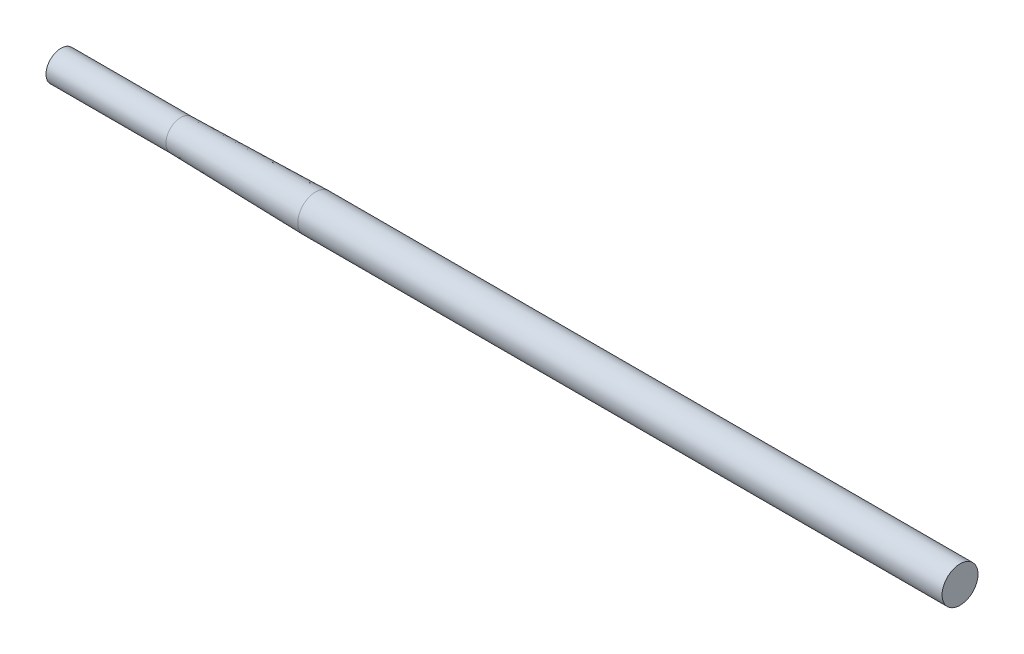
ISO-10303-21;
HEADER;
FILE_DESCRIPTION(('STEP AP214'),'2;1');
FILE_NAME('part.step','',(''),(''),'','','');
FILE_SCHEMA(('AUTOMOTIVE_DESIGN { 1 0 10303 214 1 1 1 1 }'));
ENDSEC;
DATA;
#1=APPLICATION_CONTEXT('core data for automotive mechanical design processes');
#2=APPLICATION_PROTOCOL_DEFINITION('international standard','automotive_design',2000,#1);
#3=PRODUCT_CONTEXT('',#1,'mechanical');
#4=PRODUCT('Part','Part','',(#3));
#5=PRODUCT_RELATED_PRODUCT_CATEGORY('part','',(#4));
#6=PRODUCT_DEFINITION_FORMATION('','',#4);
#7=PRODUCT_DEFINITION_CONTEXT('part definition',#1,'design');
#8=PRODUCT_DEFINITION('design','',#6,#7);
#9=PRODUCT_DEFINITION_SHAPE('','',#8);
#10=(LENGTH_UNIT() NAMED_UNIT(*) SI_UNIT(.MILLI.,.METRE.));
#11=(NAMED_UNIT(*) PLANE_ANGLE_UNIT() SI_UNIT($,.RADIAN.));
#12=(NAMED_UNIT(*) SI_UNIT($,.STERADIAN.) SOLID_ANGLE_UNIT());
#13=UNCERTAINTY_MEASURE_WITH_UNIT(LENGTH_MEASURE(1.E-05),#10,'distance_accuracy_value','');
#14=(GEOMETRIC_REPRESENTATION_CONTEXT(3) GLOBAL_UNCERTAINTY_ASSIGNED_CONTEXT((#13)) GLOBAL_UNIT_ASSIGNED_CONTEXT((#10,
#11,#12)) REPRESENTATION_CONTEXT('',''));
#15=CARTESIAN_POINT('',(0.,0.,0.));
#16=DIRECTION('',(0.,0.,1.));
#17=DIRECTION('',(1.,0.,0.));
#18=AXIS2_PLACEMENT_3D('',#15,#16,#17);
#19=CARTESIAN_POINT('',(300.,0.,0.));
#20=DIRECTION('',(-1.,0.,0.));
#21=DIRECTION('',(0.,0.,1.));
#22=AXIS2_PLACEMENT_3D('',#19,#20,#21);
#23=PLANE('',#22);
#24=CARTESIAN_POINT('',(300.,0.,0.));
#25=DIRECTION('',(-1.,0.,0.));
#26=DIRECTION('',(0.,0.,1.));
#27=AXIS2_PLACEMENT_3D('',#24,#25,#26);
#28=CIRCLE('',#27,6.);
#29=CARTESIAN_POINT('',(300.,0.,6.));
#30=VERTEX_POINT('',#29);
#31=EDGE_CURVE('E10',#30,#30,#28,.T.);
#32=ORIENTED_EDGE('',*,*,#31,.F.);
#33=EDGE_LOOP('',(#32));
#34=FACE_BOUND('',#33,.T.);
#35=ADVANCED_FACE('F31',(#34),#23,.F.);
#36=CARTESIAN_POINT('',(0.,0.,0.));
#37=DIRECTION('',(-1.,0.,0.));
#38=DIRECTION('',(0.,0.,1.));
#39=AXIS2_PLACEMENT_3D('',#36,#37,#38);
#40=CYLINDRICAL_SURFACE('',#39,5.99999999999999);
#41=CARTESIAN_POINT('',(85.,0.,0.));
#42=DIRECTION('',(-1.,0.,0.));
#43=DIRECTION('',(0.,0.,1.));
#44=AXIS2_PLACEMENT_3D('',#41,#42,#43);
#45=CIRCLE('',#44,5.99999999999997);
#46=CARTESIAN_POINT('',(85.,0.,5.99999999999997));
#47=VERTEX_POINT('',#46);
#48=EDGE_CURVE('E37',#47,#47,#45,.T.);
#49=ORIENTED_EDGE('',*,*,#48,.F.);
#50=EDGE_LOOP('',(#49));
#51=FACE_BOUND('',#50,.T.);
#52=ORIENTED_EDGE('',*,*,#31,.T.);
#53=EDGE_LOOP('',(#52));
#54=FACE_BOUND('',#53,.T.);
#55=ADVANCED_FACE('F61',(#51,#54),#40,.T.);
#56=CARTESIAN_POINT('',(85.,0.,0.));
#57=DIRECTION('',(1.,0.,0.));
#58=DIRECTION('',(0.,0.,-1.));
#59=AXIS2_PLACEMENT_3D('',#56,#57,#58);
#60=CONICAL_SURFACE('',#59,5.99999999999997,0.0222185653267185);
#61=CARTESIAN_POINT('',(40.,0.,0.));
#62=DIRECTION('',(-1.,0.,0.));
#63=DIRECTION('',(0.,0.,1.));
#64=AXIS2_PLACEMENT_3D('',#61,#62,#63);
#65=CIRCLE('',#64,5.);
#66=CARTESIAN_POINT('',(40.,0.,5.));
#67=VERTEX_POINT('',#66);
#68=EDGE_CURVE('E41',#67,#67,#65,.T.);
#69=ORIENTED_EDGE('',*,*,#68,.F.);
#70=EDGE_LOOP('',(#69));
#71=FACE_BOUND('',#70,.T.);
#72=ORIENTED_EDGE('',*,*,#48,.T.);
#73=EDGE_LOOP('',(#72));
#74=FACE_BOUND('',#73,.T.);
#75=ADVANCED_FACE('F56',(#71,#74),#60,.T.);
#76=CARTESIAN_POINT('',(0.,0.,0.));
#77=DIRECTION('',(-1.,0.,0.));
#78=DIRECTION('',(0.,0.,1.));
#79=AXIS2_PLACEMENT_3D('',#76,#77,#78);
#80=CYLINDRICAL_SURFACE('',#79,5.);
#81=CARTESIAN_POINT('',(0.,0.,0.));
#82=DIRECTION('',(-1.,0.,0.));
#83=DIRECTION('',(0.,0.,1.));
#84=AXIS2_PLACEMENT_3D('',#81,#82,#83);
#85=CIRCLE('',#84,5.);
#86=CARTESIAN_POINT('',(0.,0.,5.));
#87=VERTEX_POINT('',#86);
#88=EDGE_CURVE('E45',#87,#87,#85,.T.);
#89=ORIENTED_EDGE('',*,*,#88,.F.);
#90=EDGE_LOOP('',(#89));
#91=FACE_BOUND('',#90,.T.);
#92=ORIENTED_EDGE('',*,*,#68,.T.);
#93=EDGE_LOOP('',(#92));
#94=FACE_BOUND('',#93,.T.);
#95=ADVANCED_FACE('F53',(#91,#94),#80,.T.);
#96=CARTESIAN_POINT('',(0.,5.,0.));
#97=DIRECTION('',(1.,0.,0.));
#98=DIRECTION('',(0.,0.,-1.));
#99=AXIS2_PLACEMENT_3D('',#96,#97,#98);
#100=PLANE('',#99);
#101=ORIENTED_EDGE('',*,*,#88,.T.);
#102=EDGE_LOOP('',(#101));
#103=FACE_BOUND('',#102,.T.);
#104=ADVANCED_FACE('F51',(#103),#100,.F.);
#105=CLOSED_SHELL('',(#35,#55,#75,#95,#104));
#106=MANIFOLD_SOLID_BREP('B2',#105);
#107=ADVANCED_BREP_SHAPE_REPRESENTATION('',(#18,#106),#14);
#108=SHAPE_DEFINITION_REPRESENTATION(#9,#107);
ENDSEC;
END-ISO-10303-21;
